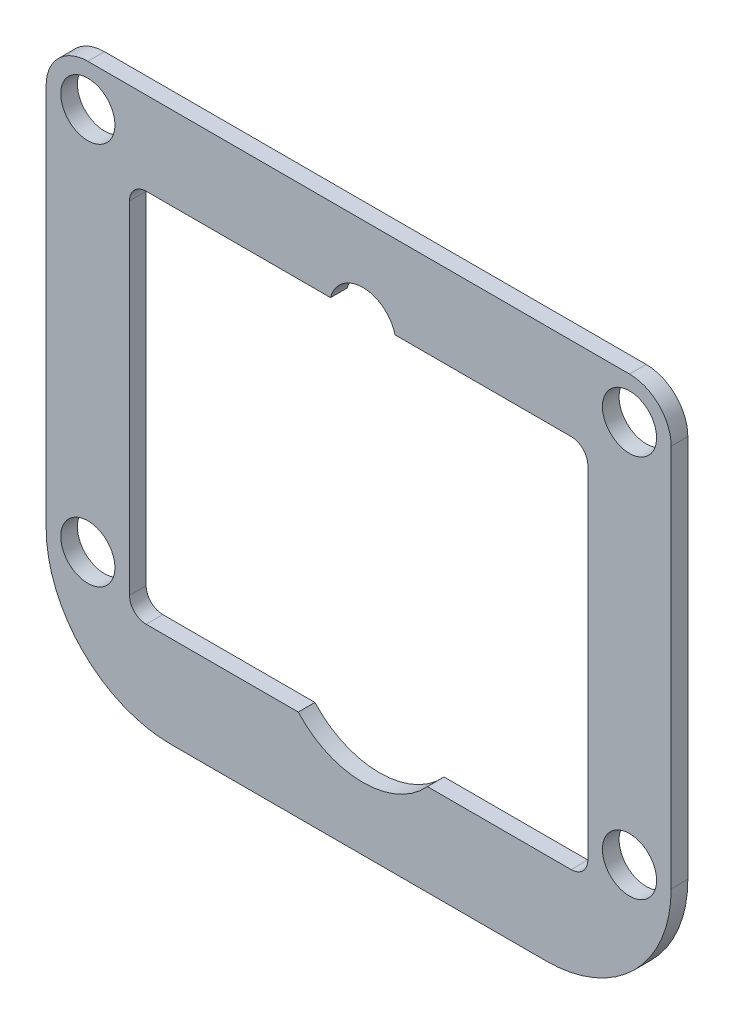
ISO-10303-21;
HEADER;
FILE_DESCRIPTION(('STEP AP214'),'2;1');
FILE_NAME('part.step','',(''),(''),'','','');
FILE_SCHEMA(('AUTOMOTIVE_DESIGN { 1 0 10303 214 1 1 1 1 }'));
ENDSEC;
DATA;
#1=APPLICATION_CONTEXT('core data for automotive mechanical design processes');
#2=APPLICATION_PROTOCOL_DEFINITION('international standard','automotive_design',2000,#1);
#3=PRODUCT_CONTEXT('',#1,'mechanical');
#4=PRODUCT('Part','Part','',(#3));
#5=PRODUCT_RELATED_PRODUCT_CATEGORY('part','',(#4));
#6=PRODUCT_DEFINITION_FORMATION('','',#4);
#7=PRODUCT_DEFINITION_CONTEXT('part definition',#1,'design');
#8=PRODUCT_DEFINITION('design','',#6,#7);
#9=PRODUCT_DEFINITION_SHAPE('','',#8);
#10=(LENGTH_UNIT() NAMED_UNIT(*) SI_UNIT(.MILLI.,.METRE.));
#11=(NAMED_UNIT(*) PLANE_ANGLE_UNIT() SI_UNIT($,.RADIAN.));
#12=(NAMED_UNIT(*) SI_UNIT($,.STERADIAN.) SOLID_ANGLE_UNIT());
#13=UNCERTAINTY_MEASURE_WITH_UNIT(LENGTH_MEASURE(1.E-05),#10,'distance_accuracy_value','');
#14=(GEOMETRIC_REPRESENTATION_CONTEXT(3) GLOBAL_UNCERTAINTY_ASSIGNED_CONTEXT((#13)) GLOBAL_UNIT_ASSIGNED_CONTEXT((#10,
#11,#12)) REPRESENTATION_CONTEXT('',''));
#15=CARTESIAN_POINT('',(0.,0.,0.));
#16=DIRECTION('',(0.,0.,1.));
#17=DIRECTION('',(1.,0.,0.));
#18=AXIS2_PLACEMENT_3D('',#15,#16,#17);
#19=CARTESIAN_POINT('',(65.,-10.,-8.));
#20=DIRECTION('',(0.,1.,0.));
#21=DIRECTION('',(-1.,0.,0.));
#22=AXIS2_PLACEMENT_3D('',#19,#20,#21);
#23=PLANE('',#22);
#24=DIRECTION('',(-1.,0.,0.));
#25=VECTOR('',#24,1.);
#26=CARTESIAN_POINT('',(65.,-10.,2.));
#27=LINE('',#26,#25);
#28=CARTESIAN_POINT('',(34.1270166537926,-10.,2.));
#29=VERTEX_POINT('',#28);
#30=CARTESIAN_POINT('',(12.,-9.99999999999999,2.));
#31=VERTEX_POINT('',#30);
#32=EDGE_CURVE('E175',#29,#31,#27,.T.);
#33=ORIENTED_EDGE('',*,*,#32,.T.);
#34=DIRECTION('',(0.,0.,1.));
#35=VECTOR('',#34,1.);
#36=CARTESIAN_POINT('',(12.,-9.99999999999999,-8.));
#37=LINE('',#36,#35);
#38=CARTESIAN_POINT('',(12.,-10.,0.));
#39=VERTEX_POINT('',#38);
#40=EDGE_CURVE('E290',#31,#39,#37,.F.);
#41=ORIENTED_EDGE('',*,*,#40,.T.);
#42=DIRECTION('',(1.,0.,0.));
#43=VECTOR('',#42,1.);
#44=CARTESIAN_POINT('',(0.,-9.99999999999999,0.));
#45=LINE('',#44,#43);
#46=CARTESIAN_POINT('',(34.1270166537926,-10.,0.));
#47=VERTEX_POINT('',#46);
#48=EDGE_CURVE('E276',#39,#47,#45,.T.);
#49=ORIENTED_EDGE('',*,*,#48,.T.);
#50=DIRECTION('',(0.,0.,1.));
#51=VECTOR('',#50,1.);
#52=CARTESIAN_POINT('',(34.1270166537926,-10.,-8.));
#53=LINE('',#52,#51);
#54=EDGE_CURVE('E184',#47,#29,#53,.T.);
#55=ORIENTED_EDGE('',*,*,#54,.T.);
#56=EDGE_LOOP('',(#33,#41,#49,#55));
#57=FACE_BOUND('',#56,.T.);
#58=ADVANCED_FACE('F26',(#57),#23,.F.);
#59=CARTESIAN_POINT('',(0.,-66.,2.));
#60=DIRECTION('',(0.,0.,-1.));
#61=DIRECTION('',(-1.,0.,0.));
#62=AXIS2_PLACEMENT_3D('',#59,#60,#61);
#63=PLANE('',#62);
#64=CARTESIAN_POINT('',(70.,-5.,2.));
#65=DIRECTION('',(0.,0.,-1.));
#66=DIRECTION('',(-1.,0.,0.));
#67=AXIS2_PLACEMENT_3D('',#64,#65,#66);
#68=CIRCLE('',#67,3.24999999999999);
#69=CARTESIAN_POINT('',(66.75,-5.,2.));
#70=VERTEX_POINT('',#69);
#71=EDGE_CURVE('E198',#70,#70,#68,.T.);
#72=ORIENTED_EDGE('',*,*,#71,.T.);
#73=EDGE_LOOP('',(#72));
#74=FACE_BOUND('',#73,.T.);
#75=CARTESIAN_POINT('',(5.,-51.,2.));
#76=DIRECTION('',(0.,0.,1.));
#77=DIRECTION('',(1.,0.,0.));
#78=AXIS2_PLACEMENT_3D('',#75,#76,#77);
#79=CIRCLE('',#78,3.25);
#80=CARTESIAN_POINT('',(8.25,-51.,2.));
#81=VERTEX_POINT('',#80);
#82=EDGE_CURVE('E213',#81,#81,#79,.T.);
#83=ORIENTED_EDGE('',*,*,#82,.F.);
#84=EDGE_LOOP('',(#83));
#85=FACE_BOUND('',#84,.T.);
#86=CARTESIAN_POINT('',(5.,-5.,2.));
#87=DIRECTION('',(0.,0.,1.));
#88=DIRECTION('',(1.,0.,0.));
#89=AXIS2_PLACEMENT_3D('',#86,#87,#88);
#90=CIRCLE('',#89,3.25);
#91=CARTESIAN_POINT('',(8.25,-5.,2.));
#92=VERTEX_POINT('',#91);
#93=EDGE_CURVE('E217',#92,#92,#90,.T.);
#94=ORIENTED_EDGE('',*,*,#93,.F.);
#95=EDGE_LOOP('',(#94));
#96=FACE_BOUND('',#95,.T.);
#97=ORIENTED_EDGE('',*,*,#32,.F.);
#98=CARTESIAN_POINT('',(38.,-11.,2.));
#99=DIRECTION('',(0.,0.,1.));
#100=DIRECTION('',(1.,0.,0.));
#101=AXIS2_PLACEMENT_3D('',#98,#99,#100);
#102=CIRCLE('',#101,4.);
#103=CARTESIAN_POINT('',(41.8729833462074,-10.,2.));
#104=VERTEX_POINT('',#103);
#105=EDGE_CURVE('E180',#104,#29,#102,.T.);
#106=ORIENTED_EDGE('',*,*,#105,.F.);
#107=CARTESIAN_POINT('',(63.,-10.,2.));
#108=VERTEX_POINT('',#107);
#109=EDGE_CURVE('E164',#108,#104,#27,.T.);
#110=ORIENTED_EDGE('',*,*,#109,.F.);
#111=CARTESIAN_POINT('',(63.,-12.,2.));
#112=DIRECTION('',(0.,0.,-1.));
#113=DIRECTION('',(-1.,0.,0.));
#114=AXIS2_PLACEMENT_3D('',#111,#112,#113);
#115=CIRCLE('',#114,2.);
#116=CARTESIAN_POINT('',(65.,-12.,2.));
#117=VERTEX_POINT('',#116);
#118=EDGE_CURVE('E309',#108,#117,#115,.T.);
#119=ORIENTED_EDGE('',*,*,#118,.T.);
#120=DIRECTION('',(0.,-1.,0.));
#121=VECTOR('',#120,1.);
#122=CARTESIAN_POINT('',(65.,-10.,2.));
#123=LINE('',#122,#121);
#124=CARTESIAN_POINT('',(65.,-53.,2.));
#125=VERTEX_POINT('',#124);
#126=EDGE_CURVE('E202',#117,#125,#123,.T.);
#127=ORIENTED_EDGE('',*,*,#126,.T.);
#128=CARTESIAN_POINT('',(63.,-53.,2.));
#129=DIRECTION('',(0.,0.,-1.));
#130=DIRECTION('',(-1.,0.,0.));
#131=AXIS2_PLACEMENT_3D('',#128,#129,#130);
#132=CIRCLE('',#131,2.);
#133=CARTESIAN_POINT('',(63.,-55.,2.));
#134=VERTEX_POINT('',#133);
#135=EDGE_CURVE('E318',#125,#134,#132,.T.);
#136=ORIENTED_EDGE('',*,*,#135,.T.);
#137=DIRECTION('',(1.,0.,0.));
#138=VECTOR('',#137,1.);
#139=CARTESIAN_POINT('',(10.,-55.,2.));
#140=LINE('',#139,#138);
#141=CARTESIAN_POINT('',(45.7459666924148,-55.,2.));
#142=VERTEX_POINT('',#141);
#143=EDGE_CURVE('E205',#142,#134,#140,.T.);
#144=ORIENTED_EDGE('',*,*,#143,.F.);
#145=CARTESIAN_POINT('',(38.,-48.,2.));
#146=DIRECTION('',(0.,0.,1.));
#147=DIRECTION('',(1.,0.,0.));
#148=AXIS2_PLACEMENT_3D('',#145,#146,#147);
#149=CIRCLE('',#148,10.4403065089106);
#150=CARTESIAN_POINT('',(30.2540333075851,-55.,2.));
#151=VERTEX_POINT('',#150);
#152=EDGE_CURVE('E221',#151,#142,#149,.T.);
#153=ORIENTED_EDGE('',*,*,#152,.F.);
#154=CARTESIAN_POINT('',(12.,-55.,2.));
#155=VERTEX_POINT('',#154);
#156=EDGE_CURVE('E206',#155,#151,#140,.T.);
#157=ORIENTED_EDGE('',*,*,#156,.F.);
#158=CARTESIAN_POINT('',(12.,-53.,2.));
#159=DIRECTION('',(0.,0.,-1.));
#160=DIRECTION('',(-1.,0.,0.));
#161=AXIS2_PLACEMENT_3D('',#158,#159,#160);
#162=CIRCLE('',#161,2.);
#163=CARTESIAN_POINT('',(10.,-53.,2.));
#164=VERTEX_POINT('',#163);
#165=EDGE_CURVE('E301',#155,#164,#162,.T.);
#166=ORIENTED_EDGE('',*,*,#165,.T.);
#167=DIRECTION('',(0.,1.,0.));
#168=VECTOR('',#167,1.);
#169=CARTESIAN_POINT('',(10.,-55.,2.));
#170=LINE('',#169,#168);
#171=CARTESIAN_POINT('',(10.,-12.,2.));
#172=VERTEX_POINT('',#171);
#173=EDGE_CURVE('E208',#164,#172,#170,.T.);
#174=ORIENTED_EDGE('',*,*,#173,.T.);
#175=CARTESIAN_POINT('',(12.,-12.,2.));
#176=DIRECTION('',(0.,0.,-1.));
#177=DIRECTION('',(-1.,0.,0.));
#178=AXIS2_PLACEMENT_3D('',#175,#176,#177);
#179=CIRCLE('',#178,2.);
#180=EDGE_CURVE('E292',#172,#31,#179,.T.);
#181=ORIENTED_EDGE('',*,*,#180,.T.);
#182=EDGE_LOOP('',(#97,#106,#110,#119,#127,#136,#144,#153,#157,#166,#174,#181));
#183=FACE_BOUND('',#182,.T.);
#184=DIRECTION('',(0.,1.,0.));
#185=VECTOR('',#184,1.);
#186=CARTESIAN_POINT('',(75.,-66.,2.));
#187=LINE('',#186,#185);
#188=CARTESIAN_POINT('',(75.,-51.,2.));
#189=VERTEX_POINT('',#188);
#190=CARTESIAN_POINT('',(75.,-5.,2.));
#191=VERTEX_POINT('',#190);
#192=EDGE_CURVE('E237',#189,#191,#187,.T.);
#193=ORIENTED_EDGE('',*,*,#192,.T.);
#194=CARTESIAN_POINT('',(70.,-5.,2.));
#195=DIRECTION('',(0.,0.,-1.));
#196=DIRECTION('',(-1.,0.,0.));
#197=AXIS2_PLACEMENT_3D('',#194,#195,#196);
#198=CIRCLE('',#197,5.);
#199=CARTESIAN_POINT('',(70.,0.,2.));
#200=VERTEX_POINT('',#199);
#201=EDGE_CURVE('E11',#191,#200,#198,.F.);
#202=ORIENTED_EDGE('',*,*,#201,.T.);
#203=DIRECTION('',(1.,0.,0.));
#204=VECTOR('',#203,1.);
#205=CARTESIAN_POINT('',(0.,0.,2.));
#206=LINE('',#205,#204);
#207=CARTESIAN_POINT('',(5.,0.,2.));
#208=VERTEX_POINT('',#207);
#209=EDGE_CURVE('E239',#208,#200,#206,.T.);
#210=ORIENTED_EDGE('',*,*,#209,.F.);
#211=CARTESIAN_POINT('',(5.,-5.,2.));
#212=DIRECTION('',(0.,0.,-1.));
#213=DIRECTION('',(-1.,0.,0.));
#214=AXIS2_PLACEMENT_3D('',#211,#212,#213);
#215=CIRCLE('',#214,5.);
#216=CARTESIAN_POINT('',(0.,-5.,2.));
#217=VERTEX_POINT('',#216);
#218=EDGE_CURVE('E329',#208,#217,#215,.F.);
#219=ORIENTED_EDGE('',*,*,#218,.T.);
#220=DIRECTION('',(0.,-1.,0.));
#221=VECTOR('',#220,1.);
#222=CARTESIAN_POINT('',(0.,0.,2.));
#223=LINE('',#222,#221);
#224=CARTESIAN_POINT('',(0.,-51.,2.));
#225=VERTEX_POINT('',#224);
#226=EDGE_CURVE('E233',#217,#225,#223,.T.);
#227=ORIENTED_EDGE('',*,*,#226,.T.);
#228=CARTESIAN_POINT('',(15.,-51.,2.));
#229=DIRECTION('',(0.,0.,-1.));
#230=DIRECTION('',(-1.,0.,0.));
#231=AXIS2_PLACEMENT_3D('',#228,#229,#230);
#232=CIRCLE('',#231,15.);
#233=CARTESIAN_POINT('',(15.,-66.,2.));
#234=VERTEX_POINT('',#233);
#235=EDGE_CURVE('E251',#225,#234,#232,.F.);
#236=ORIENTED_EDGE('',*,*,#235,.T.);
#237=DIRECTION('',(-1.,0.,0.));
#238=VECTOR('',#237,1.);
#239=CARTESIAN_POINT('',(75.,-66.,2.));
#240=LINE('',#239,#238);
#241=CARTESIAN_POINT('',(60.,-66.,2.));
#242=VERTEX_POINT('',#241);
#243=EDGE_CURVE('E235',#242,#234,#240,.T.);
#244=ORIENTED_EDGE('',*,*,#243,.F.);
#245=CARTESIAN_POINT('',(60.,-51.,2.));
#246=DIRECTION('',(0.,0.,-1.));
#247=DIRECTION('',(-1.,0.,0.));
#248=AXIS2_PLACEMENT_3D('',#245,#246,#247);
#249=CIRCLE('',#248,15.);
#250=EDGE_CURVE('E261',#242,#189,#249,.F.);
#251=ORIENTED_EDGE('',*,*,#250,.T.);
#252=EDGE_LOOP('',(#193,#202,#210,#219,#227,#236,#244,#251));
#253=FACE_BOUND('',#252,.T.);
#254=CARTESIAN_POINT('',(70.,-51.,2.));
#255=DIRECTION('',(0.,0.,-1.));
#256=DIRECTION('',(-1.,0.,0.));
#257=AXIS2_PLACEMENT_3D('',#254,#255,#256);
#258=CIRCLE('',#257,3.24999999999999);
#259=CARTESIAN_POINT('',(66.75,-51.,2.));
#260=VERTEX_POINT('',#259);
#261=EDGE_CURVE('E192',#260,#260,#258,.T.);
#262=ORIENTED_EDGE('',*,*,#261,.T.);
#263=EDGE_LOOP('',(#262));
#264=FACE_BOUND('',#263,.T.);
#265=ADVANCED_FACE('F188',(#74,#85,#96,#183,#253,#264),#63,.F.);
#266=CARTESIAN_POINT('',(0.,-66.,0.));
#267=DIRECTION('',(0.,0.,-1.));
#268=DIRECTION('',(-1.,0.,0.));
#269=AXIS2_PLACEMENT_3D('',#266,#267,#268);
#270=PLANE('',#269);
#271=CARTESIAN_POINT('',(38.,-11.,0.));
#272=DIRECTION('',(0.,0.,-1.));
#273=DIRECTION('',(-1.,0.,0.));
#274=AXIS2_PLACEMENT_3D('',#271,#272,#273);
#275=CIRCLE('',#274,4.);
#276=CARTESIAN_POINT('',(41.8729833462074,-10.,0.));
#277=VERTEX_POINT('',#276);
#278=EDGE_CURVE('E183',#47,#277,#275,.T.);
#279=ORIENTED_EDGE('',*,*,#278,.F.);
#280=ORIENTED_EDGE('',*,*,#48,.F.);
#281=CARTESIAN_POINT('',(12.,-12.,0.));
#282=DIRECTION('',(0.,0.,-1.));
#283=DIRECTION('',(-1.,0.,0.));
#284=AXIS2_PLACEMENT_3D('',#281,#282,#283);
#285=CIRCLE('',#284,2.);
#286=CARTESIAN_POINT('',(10.,-12.,0.));
#287=VERTEX_POINT('',#286);
#288=EDGE_CURVE('E294',#39,#287,#285,.F.);
#289=ORIENTED_EDGE('',*,*,#288,.T.);
#290=DIRECTION('',(0.,-1.,0.));
#291=VECTOR('',#290,1.);
#292=CARTESIAN_POINT('',(10.,-66.,0.));
#293=LINE('',#292,#291);
#294=CARTESIAN_POINT('',(10.,-53.,0.));
#295=VERTEX_POINT('',#294);
#296=EDGE_CURVE('E278',#287,#295,#293,.T.);
#297=ORIENTED_EDGE('',*,*,#296,.T.);
#298=CARTESIAN_POINT('',(12.,-53.,0.));
#299=DIRECTION('',(0.,0.,-1.));
#300=DIRECTION('',(-1.,0.,0.));
#301=AXIS2_PLACEMENT_3D('',#298,#299,#300);
#302=CIRCLE('',#301,2.);
#303=CARTESIAN_POINT('',(12.,-55.,0.));
#304=VERTEX_POINT('',#303);
#305=EDGE_CURVE('E303',#295,#304,#302,.F.);
#306=ORIENTED_EDGE('',*,*,#305,.T.);
#307=DIRECTION('',(-1.,0.,0.));
#308=VECTOR('',#307,1.);
#309=CARTESIAN_POINT('',(0.,-55.,0.));
#310=LINE('',#309,#308);
#311=CARTESIAN_POINT('',(30.2540333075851,-55.,0.));
#312=VERTEX_POINT('',#311);
#313=EDGE_CURVE('E174',#312,#304,#310,.T.);
#314=ORIENTED_EDGE('',*,*,#313,.F.);
#315=CARTESIAN_POINT('',(38.,-48.,0.));
#316=DIRECTION('',(0.,0.,-1.));
#317=DIRECTION('',(-1.,0.,0.));
#318=AXIS2_PLACEMENT_3D('',#315,#316,#317);
#319=CIRCLE('',#318,10.4403065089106);
#320=CARTESIAN_POINT('',(45.7459666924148,-55.,0.));
#321=VERTEX_POINT('',#320);
#322=EDGE_CURVE('E224',#321,#312,#319,.T.);
#323=ORIENTED_EDGE('',*,*,#322,.F.);
#324=CARTESIAN_POINT('',(63.,-55.,0.));
#325=VERTEX_POINT('',#324);
#326=EDGE_CURVE('E212',#325,#321,#310,.T.);
#327=ORIENTED_EDGE('',*,*,#326,.F.);
#328=CARTESIAN_POINT('',(63.,-53.,0.));
#329=DIRECTION('',(0.,0.,-1.));
#330=DIRECTION('',(-1.,0.,0.));
#331=AXIS2_PLACEMENT_3D('',#328,#329,#330);
#332=CIRCLE('',#331,2.);
#333=CARTESIAN_POINT('',(65.,-53.,0.));
#334=VERTEX_POINT('',#333);
#335=EDGE_CURVE('E320',#325,#334,#332,.F.);
#336=ORIENTED_EDGE('',*,*,#335,.T.);
#337=DIRECTION('',(0.,1.,0.));
#338=VECTOR('',#337,1.);
#339=CARTESIAN_POINT('',(65.,-66.,0.));
#340=LINE('',#339,#338);
#341=CARTESIAN_POINT('',(65.,-12.,0.));
#342=VERTEX_POINT('',#341);
#343=EDGE_CURVE('E185',#334,#342,#340,.T.);
#344=ORIENTED_EDGE('',*,*,#343,.T.);
#345=CARTESIAN_POINT('',(63.,-12.,0.));
#346=DIRECTION('',(0.,0.,-1.));
#347=DIRECTION('',(-1.,0.,0.));
#348=AXIS2_PLACEMENT_3D('',#345,#346,#347);
#349=CIRCLE('',#348,2.);
#350=CARTESIAN_POINT('',(63.,-10.,0.));
#351=VERTEX_POINT('',#350);
#352=EDGE_CURVE('E311',#342,#351,#349,.F.);
#353=ORIENTED_EDGE('',*,*,#352,.T.);
#354=EDGE_CURVE('E275',#277,#351,#45,.T.);
#355=ORIENTED_EDGE('',*,*,#354,.F.);
#356=EDGE_LOOP('',(#279,#280,#289,#297,#306,#314,#323,#327,#336,#344,#353,#355));
#357=FACE_BOUND('',#356,.T.);
#358=CARTESIAN_POINT('',(70.,-5.,0.));
#359=DIRECTION('',(0.,0.,-1.));
#360=DIRECTION('',(-1.,0.,0.));
#361=AXIS2_PLACEMENT_3D('',#358,#359,#360);
#362=CIRCLE('',#361,3.24999999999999);
#363=CARTESIAN_POINT('',(66.75,-5.,0.));
#364=VERTEX_POINT('',#363);
#365=EDGE_CURVE('E201',#364,#364,#362,.F.);
#366=ORIENTED_EDGE('',*,*,#365,.T.);
#367=EDGE_LOOP('',(#366));
#368=FACE_BOUND('',#367,.T.);
#369=CARTESIAN_POINT('',(5.,-51.,0.));
#370=DIRECTION('',(0.,0.,-1.));
#371=DIRECTION('',(-1.,0.,0.));
#372=AXIS2_PLACEMENT_3D('',#369,#370,#371);
#373=CIRCLE('',#372,3.25);
#374=CARTESIAN_POINT('',(1.75,-51.,0.));
#375=VERTEX_POINT('',#374);
#376=EDGE_CURVE('E216',#375,#375,#373,.T.);
#377=ORIENTED_EDGE('',*,*,#376,.F.);
#378=EDGE_LOOP('',(#377));
#379=FACE_BOUND('',#378,.T.);
#380=CARTESIAN_POINT('',(5.,-5.,0.));
#381=DIRECTION('',(0.,0.,-1.));
#382=DIRECTION('',(-1.,0.,0.));
#383=AXIS2_PLACEMENT_3D('',#380,#381,#382);
#384=CIRCLE('',#383,3.25);
#385=CARTESIAN_POINT('',(1.75,-5.,0.));
#386=VERTEX_POINT('',#385);
#387=EDGE_CURVE('E220',#386,#386,#384,.T.);
#388=ORIENTED_EDGE('',*,*,#387,.F.);
#389=EDGE_LOOP('',(#388));
#390=FACE_BOUND('',#389,.T.);
#391=DIRECTION('',(1.,0.,0.));
#392=VECTOR('',#391,1.);
#393=CARTESIAN_POINT('',(0.,0.,0.));
#394=LINE('',#393,#392);
#395=CARTESIAN_POINT('',(5.,0.,0.));
#396=VERTEX_POINT('',#395);
#397=CARTESIAN_POINT('',(70.,0.,0.));
#398=VERTEX_POINT('',#397);
#399=EDGE_CURVE('E231',#396,#398,#394,.T.);
#400=ORIENTED_EDGE('',*,*,#399,.T.);
#401=CARTESIAN_POINT('',(70.,-5.,0.));
#402=DIRECTION('',(0.,0.,-1.));
#403=DIRECTION('',(-1.,0.,0.));
#404=AXIS2_PLACEMENT_3D('',#401,#402,#403);
#405=CIRCLE('',#404,5.);
#406=CARTESIAN_POINT('',(75.,-5.,0.));
#407=VERTEX_POINT('',#406);
#408=EDGE_CURVE('E48',#398,#407,#405,.T.);
#409=ORIENTED_EDGE('',*,*,#408,.T.);
#410=DIRECTION('',(0.,1.,0.));
#411=VECTOR('',#410,1.);
#412=CARTESIAN_POINT('',(75.,-66.,0.));
#413=LINE('',#412,#411);
#414=CARTESIAN_POINT('',(75.,-51.,0.));
#415=VERTEX_POINT('',#414);
#416=EDGE_CURVE('E229',#415,#407,#413,.T.);
#417=ORIENTED_EDGE('',*,*,#416,.F.);
#418=CARTESIAN_POINT('',(60.,-51.,0.));
#419=DIRECTION('',(0.,0.,-1.));
#420=DIRECTION('',(-1.,0.,0.));
#421=AXIS2_PLACEMENT_3D('',#418,#419,#420);
#422=CIRCLE('',#421,15.);
#423=CARTESIAN_POINT('',(60.,-66.,0.));
#424=VERTEX_POINT('',#423);
#425=EDGE_CURVE('E257',#415,#424,#422,.T.);
#426=ORIENTED_EDGE('',*,*,#425,.T.);
#427=DIRECTION('',(-1.,0.,0.));
#428=VECTOR('',#427,1.);
#429=CARTESIAN_POINT('',(75.,-66.,0.));
#430=LINE('',#429,#428);
#431=CARTESIAN_POINT('',(15.,-66.,0.));
#432=VERTEX_POINT('',#431);
#433=EDGE_CURVE('E227',#424,#432,#430,.T.);
#434=ORIENTED_EDGE('',*,*,#433,.T.);
#435=CARTESIAN_POINT('',(15.,-51.,0.));
#436=DIRECTION('',(0.,0.,-1.));
#437=DIRECTION('',(-1.,0.,0.));
#438=AXIS2_PLACEMENT_3D('',#435,#436,#437);
#439=CIRCLE('',#438,15.);
#440=CARTESIAN_POINT('',(0.,-51.,0.));
#441=VERTEX_POINT('',#440);
#442=EDGE_CURVE('E245',#432,#441,#439,.T.);
#443=ORIENTED_EDGE('',*,*,#442,.T.);
#444=DIRECTION('',(0.,-1.,0.));
#445=VECTOR('',#444,1.);
#446=CARTESIAN_POINT('',(0.,0.,0.));
#447=LINE('',#446,#445);
#448=CARTESIAN_POINT('',(0.,-5.,0.));
#449=VERTEX_POINT('',#448);
#450=EDGE_CURVE('E225',#449,#441,#447,.T.);
#451=ORIENTED_EDGE('',*,*,#450,.F.);
#452=CARTESIAN_POINT('',(5.,-5.,0.));
#453=DIRECTION('',(0.,0.,-1.));
#454=DIRECTION('',(-1.,0.,0.));
#455=AXIS2_PLACEMENT_3D('',#452,#453,#454);
#456=CIRCLE('',#455,5.);
#457=EDGE_CURVE('E325',#449,#396,#456,.T.);
#458=ORIENTED_EDGE('',*,*,#457,.T.);
#459=EDGE_LOOP('',(#400,#409,#417,#426,#434,#443,#451,#458));
#460=FACE_BOUND('',#459,.T.);
#461=CARTESIAN_POINT('',(70.,-51.,0.));
#462=DIRECTION('',(0.,0.,-1.));
#463=DIRECTION('',(-1.,0.,0.));
#464=AXIS2_PLACEMENT_3D('',#461,#462,#463);
#465=CIRCLE('',#464,3.24999999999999);
#466=CARTESIAN_POINT('',(66.75,-51.,0.));
#467=VERTEX_POINT('',#466);
#468=EDGE_CURVE('E197',#467,#467,#465,.F.);
#469=ORIENTED_EDGE('',*,*,#468,.T.);
#470=EDGE_LOOP('',(#469));
#471=FACE_BOUND('',#470,.T.);
#472=ADVANCED_FACE('F342',(#357,#368,#379,#390,#460,#471),#270,.T.);
#473=CARTESIAN_POINT('',(0.,0.,2.));
#474=DIRECTION('',(1.,0.,0.));
#475=DIRECTION('',(0.,1.,0.));
#476=AXIS2_PLACEMENT_3D('',#473,#474,#475);
#477=PLANE('',#476);
#478=ORIENTED_EDGE('',*,*,#226,.F.);
#479=DIRECTION('',(0.,0.,-1.));
#480=VECTOR('',#479,1.);
#481=CARTESIAN_POINT('',(0.,-5.,2.));
#482=LINE('',#481,#480);
#483=EDGE_CURVE('E322',#217,#449,#482,.T.);
#484=ORIENTED_EDGE('',*,*,#483,.T.);
#485=ORIENTED_EDGE('',*,*,#450,.T.);
#486=DIRECTION('',(0.,0.,-1.));
#487=VECTOR('',#486,1.);
#488=CARTESIAN_POINT('',(0.,-51.,2.));
#489=LINE('',#488,#487);
#490=EDGE_CURVE('E248',#441,#225,#489,.F.);
#491=ORIENTED_EDGE('',*,*,#490,.T.);
#492=EDGE_LOOP('',(#478,#484,#485,#491));
#493=FACE_BOUND('',#492,.T.);
#494=ADVANCED_FACE('F351',(#493),#477,.F.);
#495=CARTESIAN_POINT('',(75.,-66.,2.));
#496=DIRECTION('',(0.,-1.,0.));
#497=DIRECTION('',(1.,0.,0.));
#498=AXIS2_PLACEMENT_3D('',#495,#496,#497);
#499=PLANE('',#498);
#500=ORIENTED_EDGE('',*,*,#433,.F.);
#501=DIRECTION('',(0.,0.,-1.));
#502=VECTOR('',#501,1.);
#503=CARTESIAN_POINT('',(60.,-66.,2.));
#504=LINE('',#503,#502);
#505=EDGE_CURVE('E259',#424,#242,#504,.F.);
#506=ORIENTED_EDGE('',*,*,#505,.T.);
#507=ORIENTED_EDGE('',*,*,#243,.T.);
#508=DIRECTION('',(0.,0.,-1.));
#509=VECTOR('',#508,1.);
#510=CARTESIAN_POINT('',(15.,-66.,2.));
#511=LINE('',#510,#509);
#512=EDGE_CURVE('E242',#234,#432,#511,.T.);
#513=ORIENTED_EDGE('',*,*,#512,.T.);
#514=EDGE_LOOP('',(#500,#506,#507,#513));
#515=FACE_BOUND('',#514,.T.);
#516=ADVANCED_FACE('F28',(#515),#499,.T.);
#517=CARTESIAN_POINT('',(75.,-66.,2.));
#518=DIRECTION('',(-1.,0.,0.));
#519=DIRECTION('',(0.,0.,1.));
#520=AXIS2_PLACEMENT_3D('',#517,#518,#519);
#521=PLANE('',#520);
#522=ORIENTED_EDGE('',*,*,#416,.T.);
#523=DIRECTION('',(0.,0.,-1.));
#524=VECTOR('',#523,1.);
#525=CARTESIAN_POINT('',(75.,-5.,2.));
#526=LINE('',#525,#524);
#527=EDGE_CURVE('E34',#407,#191,#526,.F.);
#528=ORIENTED_EDGE('',*,*,#527,.T.);
#529=ORIENTED_EDGE('',*,*,#192,.F.);
#530=DIRECTION('',(0.,0.,-1.));
#531=VECTOR('',#530,1.);
#532=CARTESIAN_POINT('',(75.,-51.,2.));
#533=LINE('',#532,#531);
#534=EDGE_CURVE('E254',#189,#415,#533,.T.);
#535=ORIENTED_EDGE('',*,*,#534,.T.);
#536=EDGE_LOOP('',(#522,#528,#529,#535));
#537=FACE_BOUND('',#536,.T.);
#538=ADVANCED_FACE('F422',(#537),#521,.F.);
#539=CARTESIAN_POINT('',(0.,0.,2.));
#540=DIRECTION('',(0.,1.,0.));
#541=DIRECTION('',(0.,0.,1.));
#542=AXIS2_PLACEMENT_3D('',#539,#540,#541);
#543=PLANE('',#542);
#544=ORIENTED_EDGE('',*,*,#209,.T.);
#545=DIRECTION('',(0.,0.,-1.));
#546=VECTOR('',#545,1.);
#547=CARTESIAN_POINT('',(70.,0.,2.));
#548=LINE('',#547,#546);
#549=EDGE_CURVE('E331',#200,#398,#548,.T.);
#550=ORIENTED_EDGE('',*,*,#549,.T.);
#551=ORIENTED_EDGE('',*,*,#399,.F.);
#552=DIRECTION('',(0.,0.,-1.));
#553=VECTOR('',#552,1.);
#554=CARTESIAN_POINT('',(5.,0.,2.));
#555=LINE('',#554,#553);
#556=EDGE_CURVE('E327',#396,#208,#555,.F.);
#557=ORIENTED_EDGE('',*,*,#556,.T.);
#558=EDGE_LOOP('',(#544,#550,#551,#557));
#559=FACE_BOUND('',#558,.T.);
#560=ADVANCED_FACE('F337',(#559),#543,.T.);
#561=CARTESIAN_POINT('',(15.,-51.,2.));
#562=DIRECTION('',(0.,0.,1.));
#563=DIRECTION('',(1.,0.,0.));
#564=AXIS2_PLACEMENT_3D('',#561,#562,#563);
#565=CYLINDRICAL_SURFACE('',#564,15.);
#566=ORIENTED_EDGE('',*,*,#235,.F.);
#567=ORIENTED_EDGE('',*,*,#490,.F.);
#568=ORIENTED_EDGE('',*,*,#442,.F.);
#569=ORIENTED_EDGE('',*,*,#512,.F.);
#570=EDGE_LOOP('',(#566,#567,#568,#569));
#571=FACE_BOUND('',#570,.T.);
#572=ADVANCED_FACE('F411',(#571),#565,.T.);
#573=CARTESIAN_POINT('',(60.,-51.,2.));
#574=DIRECTION('',(0.,0.,1.));
#575=DIRECTION('',(1.,0.,0.));
#576=AXIS2_PLACEMENT_3D('',#573,#574,#575);
#577=CYLINDRICAL_SURFACE('',#576,15.);
#578=ORIENTED_EDGE('',*,*,#250,.F.);
#579=ORIENTED_EDGE('',*,*,#505,.F.);
#580=ORIENTED_EDGE('',*,*,#425,.F.);
#581=ORIENTED_EDGE('',*,*,#534,.F.);
#582=EDGE_LOOP('',(#578,#579,#580,#581));
#583=FACE_BOUND('',#582,.T.);
#584=ADVANCED_FACE('F407',(#583),#577,.T.);
#585=CARTESIAN_POINT('',(38.,-48.,-8.));
#586=DIRECTION('',(0.,0.,1.));
#587=DIRECTION('',(1.,0.,0.));
#588=AXIS2_PLACEMENT_3D('',#585,#586,#587);
#589=CYLINDRICAL_SURFACE('',#588,10.4403065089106);
#590=ORIENTED_EDGE('',*,*,#152,.T.);
#591=DIRECTION('',(0.,0.,1.));
#592=VECTOR('',#591,1.);
#593=CARTESIAN_POINT('',(45.7459666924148,-55.,-8.));
#594=LINE('',#593,#592);
#595=EDGE_CURVE('E272',#142,#321,#594,.F.);
#596=ORIENTED_EDGE('',*,*,#595,.T.);
#597=ORIENTED_EDGE('',*,*,#322,.T.);
#598=DIRECTION('',(0.,0.,1.));
#599=VECTOR('',#598,1.);
#600=CARTESIAN_POINT('',(30.2540333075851,-55.,-8.));
#601=LINE('',#600,#599);
#602=EDGE_CURVE('E263',#312,#151,#601,.T.);
#603=ORIENTED_EDGE('',*,*,#602,.T.);
#604=EDGE_LOOP('',(#590,#596,#597,#603));
#605=FACE_BOUND('',#604,.T.);
#606=ADVANCED_FACE('F403',(#605),#589,.F.);
#607=CARTESIAN_POINT('',(5.,-5.,-8.));
#608=DIRECTION('',(0.,0.,1.));
#609=DIRECTION('',(1.,0.,0.));
#610=AXIS2_PLACEMENT_3D('',#607,#608,#609);
#611=CYLINDRICAL_SURFACE('',#610,3.25);
#612=ORIENTED_EDGE('',*,*,#387,.T.);
#613=EDGE_LOOP('',(#612));
#614=FACE_BOUND('',#613,.T.);
#615=ORIENTED_EDGE('',*,*,#93,.T.);
#616=EDGE_LOOP('',(#615));
#617=FACE_BOUND('',#616,.T.);
#618=ADVANCED_FACE('F399',(#614,#617),#611,.F.);
#619=CARTESIAN_POINT('',(5.,-51.,-8.));
#620=DIRECTION('',(0.,0.,1.));
#621=DIRECTION('',(1.,0.,0.));
#622=AXIS2_PLACEMENT_3D('',#619,#620,#621);
#623=CYLINDRICAL_SURFACE('',#622,3.25);
#624=ORIENTED_EDGE('',*,*,#376,.T.);
#625=EDGE_LOOP('',(#624));
#626=FACE_BOUND('',#625,.T.);
#627=ORIENTED_EDGE('',*,*,#82,.T.);
#628=EDGE_LOOP('',(#627));
#629=FACE_BOUND('',#628,.T.);
#630=ADVANCED_FACE('F396',(#626,#629),#623,.F.);
#631=CARTESIAN_POINT('',(10.,-55.,-8.));
#632=DIRECTION('',(0.,-1.,0.));
#633=DIRECTION('',(0.,0.,-1.));
#634=AXIS2_PLACEMENT_3D('',#631,#632,#633);
#635=PLANE('',#634);
#636=ORIENTED_EDGE('',*,*,#143,.T.);
#637=DIRECTION('',(0.,0.,1.));
#638=VECTOR('',#637,1.);
#639=CARTESIAN_POINT('',(63.,-55.,-8.));
#640=LINE('',#639,#638);
#641=EDGE_CURVE('E316',#134,#325,#640,.F.);
#642=ORIENTED_EDGE('',*,*,#641,.T.);
#643=ORIENTED_EDGE('',*,*,#326,.T.);
#644=ORIENTED_EDGE('',*,*,#595,.F.);
#645=EDGE_LOOP('',(#636,#642,#643,#644));
#646=FACE_BOUND('',#645,.T.);
#647=ADVANCED_FACE('F393',(#646),#635,.F.);
#648=CARTESIAN_POINT('',(65.,-10.,-8.));
#649=DIRECTION('',(-1.,0.,0.));
#650=DIRECTION('',(0.,0.,1.));
#651=AXIS2_PLACEMENT_3D('',#648,#649,#650);
#652=PLANE('',#651);
#653=ORIENTED_EDGE('',*,*,#343,.F.);
#654=DIRECTION('',(0.,0.,1.));
#655=VECTOR('',#654,1.);
#656=CARTESIAN_POINT('',(65.,-53.,-8.));
#657=LINE('',#656,#655);
#658=EDGE_CURVE('E313',#334,#125,#657,.T.);
#659=ORIENTED_EDGE('',*,*,#658,.T.);
#660=ORIENTED_EDGE('',*,*,#126,.F.);
#661=DIRECTION('',(0.,0.,1.));
#662=VECTOR('',#661,1.);
#663=CARTESIAN_POINT('',(65.,-12.,-8.));
#664=LINE('',#663,#662);
#665=EDGE_CURVE('E306',#117,#342,#664,.F.);
#666=ORIENTED_EDGE('',*,*,#665,.T.);
#667=EDGE_LOOP('',(#653,#659,#660,#666));
#668=FACE_BOUND('',#667,.T.);
#669=ADVANCED_FACE('F390',(#668),#652,.T.);
#670=ORIENTED_EDGE('',*,*,#313,.T.);
#671=DIRECTION('',(0.,0.,1.));
#672=VECTOR('',#671,1.);
#673=CARTESIAN_POINT('',(12.,-55.,-8.));
#674=LINE('',#673,#672);
#675=EDGE_CURVE('E296',#304,#155,#674,.T.);
#676=ORIENTED_EDGE('',*,*,#675,.T.);
#677=ORIENTED_EDGE('',*,*,#156,.T.);
#678=ORIENTED_EDGE('',*,*,#602,.F.);
#679=EDGE_LOOP('',(#670,#676,#677,#678));
#680=FACE_BOUND('',#679,.T.);
#681=ADVANCED_FACE('F385',(#680),#635,.F.);
#682=CARTESIAN_POINT('',(10.,-55.,-8.));
#683=DIRECTION('',(1.,0.,0.));
#684=DIRECTION('',(0.,0.,-1.));
#685=AXIS2_PLACEMENT_3D('',#682,#683,#684);
#686=PLANE('',#685);
#687=ORIENTED_EDGE('',*,*,#173,.F.);
#688=DIRECTION('',(0.,0.,1.));
#689=VECTOR('',#688,1.);
#690=CARTESIAN_POINT('',(10.,-53.,-8.));
#691=LINE('',#690,#689);
#692=EDGE_CURVE('E299',#164,#295,#691,.F.);
#693=ORIENTED_EDGE('',*,*,#692,.T.);
#694=ORIENTED_EDGE('',*,*,#296,.F.);
#695=DIRECTION('',(0.,0.,1.));
#696=VECTOR('',#695,1.);
#697=CARTESIAN_POINT('',(10.,-12.,-8.));
#698=LINE('',#697,#696);
#699=EDGE_CURVE('E287',#287,#172,#698,.T.);
#700=ORIENTED_EDGE('',*,*,#699,.T.);
#701=EDGE_LOOP('',(#687,#693,#694,#700));
#702=FACE_BOUND('',#701,.T.);
#703=ADVANCED_FACE('F377',(#702),#686,.T.);
#704=ORIENTED_EDGE('',*,*,#354,.T.);
#705=DIRECTION('',(0.,0.,1.));
#706=VECTOR('',#705,1.);
#707=CARTESIAN_POINT('',(63.,-10.,-8.));
#708=LINE('',#707,#706);
#709=EDGE_CURVE('E171',#351,#108,#708,.T.);
#710=ORIENTED_EDGE('',*,*,#709,.T.);
#711=ORIENTED_EDGE('',*,*,#109,.T.);
#712=DIRECTION('',(0.,0.,1.));
#713=VECTOR('',#712,1.);
#714=CARTESIAN_POINT('',(41.8729833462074,-10.,-8.));
#715=LINE('',#714,#713);
#716=EDGE_CURVE('E168',#104,#277,#715,.F.);
#717=ORIENTED_EDGE('',*,*,#716,.T.);
#718=EDGE_LOOP('',(#704,#710,#711,#717));
#719=FACE_BOUND('',#718,.T.);
#720=ADVANCED_FACE('F167',(#719),#23,.F.);
#721=CARTESIAN_POINT('',(70.,-5.,-8.));
#722=DIRECTION('',(0.,0.,1.));
#723=DIRECTION('',(1.,0.,0.));
#724=AXIS2_PLACEMENT_3D('',#721,#722,#723);
#725=CYLINDRICAL_SURFACE('',#724,3.24999999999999);
#726=ORIENTED_EDGE('',*,*,#365,.F.);
#727=EDGE_LOOP('',(#726));
#728=FACE_BOUND('',#727,.T.);
#729=ORIENTED_EDGE('',*,*,#71,.F.);
#730=EDGE_LOOP('',(#729));
#731=FACE_BOUND('',#730,.T.);
#732=ADVANCED_FACE('F376',(#728,#731),#725,.F.);
#733=CARTESIAN_POINT('',(70.,-51.,-8.));
#734=DIRECTION('',(0.,0.,1.));
#735=DIRECTION('',(1.,0.,0.));
#736=AXIS2_PLACEMENT_3D('',#733,#734,#735);
#737=CYLINDRICAL_SURFACE('',#736,3.24999999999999);
#738=ORIENTED_EDGE('',*,*,#468,.F.);
#739=EDGE_LOOP('',(#738));
#740=FACE_BOUND('',#739,.T.);
#741=ORIENTED_EDGE('',*,*,#261,.F.);
#742=EDGE_LOOP('',(#741));
#743=FACE_BOUND('',#742,.T.);
#744=ADVANCED_FACE('F382',(#740,#743),#737,.F.);
#745=CARTESIAN_POINT('',(38.,-11.,-8.));
#746=DIRECTION('',(0.,0.,1.));
#747=DIRECTION('',(1.,0.,0.));
#748=AXIS2_PLACEMENT_3D('',#745,#746,#747);
#749=CYLINDRICAL_SURFACE('',#748,4.);
#750=ORIENTED_EDGE('',*,*,#278,.T.);
#751=ORIENTED_EDGE('',*,*,#716,.F.);
#752=ORIENTED_EDGE('',*,*,#105,.T.);
#753=ORIENTED_EDGE('',*,*,#54,.F.);
#754=EDGE_LOOP('',(#750,#751,#752,#753));
#755=FACE_BOUND('',#754,.T.);
#756=ADVANCED_FACE('F178',(#755),#749,.F.);
#757=CARTESIAN_POINT('',(12.,-12.,-8.));
#758=DIRECTION('',(0.,0.,1.));
#759=DIRECTION('',(1.,0.,0.));
#760=AXIS2_PLACEMENT_3D('',#757,#758,#759);
#761=CYLINDRICAL_SURFACE('',#760,2.);
#762=ORIENTED_EDGE('',*,*,#288,.F.);
#763=ORIENTED_EDGE('',*,*,#40,.F.);
#764=ORIENTED_EDGE('',*,*,#180,.F.);
#765=ORIENTED_EDGE('',*,*,#699,.F.);
#766=EDGE_LOOP('',(#762,#763,#764,#765));
#767=FACE_BOUND('',#766,.T.);
#768=ADVANCED_FACE('F496',(#767),#761,.F.);
#769=CARTESIAN_POINT('',(12.,-53.,-8.));
#770=DIRECTION('',(0.,0.,1.));
#771=DIRECTION('',(1.,0.,0.));
#772=AXIS2_PLACEMENT_3D('',#769,#770,#771);
#773=CYLINDRICAL_SURFACE('',#772,2.);
#774=ORIENTED_EDGE('',*,*,#305,.F.);
#775=ORIENTED_EDGE('',*,*,#692,.F.);
#776=ORIENTED_EDGE('',*,*,#165,.F.);
#777=ORIENTED_EDGE('',*,*,#675,.F.);
#778=EDGE_LOOP('',(#774,#775,#776,#777));
#779=FACE_BOUND('',#778,.T.);
#780=ADVANCED_FACE('F503',(#779),#773,.F.);
#781=CARTESIAN_POINT('',(63.,-12.,-8.));
#782=DIRECTION('',(0.,0.,1.));
#783=DIRECTION('',(1.,0.,0.));
#784=AXIS2_PLACEMENT_3D('',#781,#782,#783);
#785=CYLINDRICAL_SURFACE('',#784,2.);
#786=ORIENTED_EDGE('',*,*,#352,.F.);
#787=ORIENTED_EDGE('',*,*,#665,.F.);
#788=ORIENTED_EDGE('',*,*,#118,.F.);
#789=ORIENTED_EDGE('',*,*,#709,.F.);
#790=EDGE_LOOP('',(#786,#787,#788,#789));
#791=FACE_BOUND('',#790,.T.);
#792=ADVANCED_FACE('F511',(#791),#785,.F.);
#793=CARTESIAN_POINT('',(63.,-53.,-8.));
#794=DIRECTION('',(0.,0.,1.));
#795=DIRECTION('',(1.,0.,0.));
#796=AXIS2_PLACEMENT_3D('',#793,#794,#795);
#797=CYLINDRICAL_SURFACE('',#796,2.);
#798=ORIENTED_EDGE('',*,*,#335,.F.);
#799=ORIENTED_EDGE('',*,*,#641,.F.);
#800=ORIENTED_EDGE('',*,*,#135,.F.);
#801=ORIENTED_EDGE('',*,*,#658,.F.);
#802=EDGE_LOOP('',(#798,#799,#800,#801));
#803=FACE_BOUND('',#802,.T.);
#804=ADVANCED_FACE('F363',(#803),#797,.F.);
#805=CARTESIAN_POINT('',(5.,-5.,2.));
#806=DIRECTION('',(0.,0.,1.));
#807=DIRECTION('',(1.,0.,0.));
#808=AXIS2_PLACEMENT_3D('',#805,#806,#807);
#809=CYLINDRICAL_SURFACE('',#808,5.);
#810=ORIENTED_EDGE('',*,*,#218,.F.);
#811=ORIENTED_EDGE('',*,*,#556,.F.);
#812=ORIENTED_EDGE('',*,*,#457,.F.);
#813=ORIENTED_EDGE('',*,*,#483,.F.);
#814=EDGE_LOOP('',(#810,#811,#812,#813));
#815=FACE_BOUND('',#814,.T.);
#816=ADVANCED_FACE('F348',(#815),#809,.T.);
#817=CARTESIAN_POINT('',(70.,-5.,2.));
#818=DIRECTION('',(0.,0.,1.));
#819=DIRECTION('',(1.,0.,0.));
#820=AXIS2_PLACEMENT_3D('',#817,#818,#819);
#821=CYLINDRICAL_SURFACE('',#820,5.);
#822=ORIENTED_EDGE('',*,*,#201,.F.);
#823=ORIENTED_EDGE('',*,*,#527,.F.);
#824=ORIENTED_EDGE('',*,*,#408,.F.);
#825=ORIENTED_EDGE('',*,*,#549,.F.);
#826=EDGE_LOOP('',(#822,#823,#824,#825));
#827=FACE_BOUND('',#826,.T.);
#828=ADVANCED_FACE('F357',(#827),#821,.T.);
#829=CLOSED_SHELL('',(#58,#265,#472,#494,#516,#538,#560,#572,#584,#606,#618,#630,#647,#669,#681,
#703,#720,#732,#744,#756,#768,#780,#792,#804,#816,#828));
#830=MANIFOLD_SOLID_BREP('B2',#829);
#831=ADVANCED_BREP_SHAPE_REPRESENTATION('',(#18,#830),#14);
#832=SHAPE_DEFINITION_REPRESENTATION(#9,#831);
ENDSEC;
END-ISO-10303-21;
